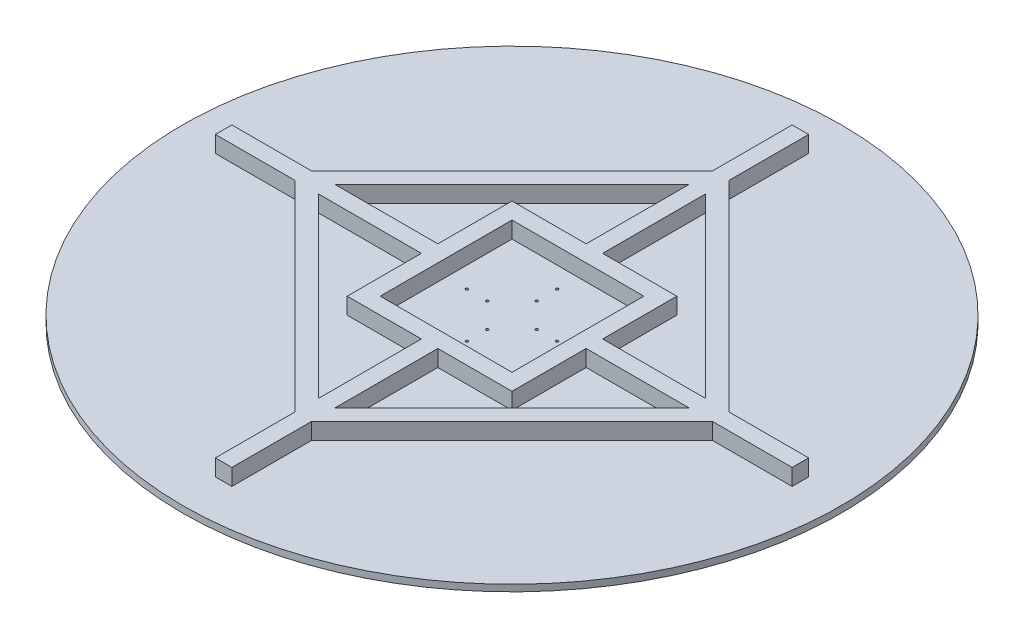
from build123d import *

# Parameters (mm, degrees)
SKETCH_1_R          = 400
SKETCH_1_R_2        = 1.55
EXTRUDE_1_DEPTH     = 8
SKETCH_3_R          = 1.55
CUT_EXTRUDE_1_DEPTH = 8
SKETCH_4_W          = 160
SKETCH_4_H          = 160
EXTRUDE_2_DEPTH     = 20


with BuildPart() as part:
    # Sketch 1 → Extrude 1 (new body)
    with BuildSketch(Plane(origin=(0, 0, 0), x_dir=(1, 0, 0), z_dir=(0, 1, 0))):
        with Locations(Location((0, 0, 0), (0, 0, 270))):
            Circle(SKETCH_1_R)
        with Locations(Location((54.8, 0, 0), (0, 0, 270))):
            Circle(SKETCH_1_R_2, mode=Mode.SUBTRACT)
        with Locations(Location((0, -54.8, 0), (0, 0, 270))):
            Circle(SKETCH_1_R_2, mode=Mode.SUBTRACT)
        with Locations(Location((-54.8, 0, 0), (0, 0, 270))):
            Circle(SKETCH_1_R_2, mode=Mode.SUBTRACT)
        with Locations(Location((0, 54.8, 0), (0, 0, 270))):
            Circle(SKETCH_1_R_2, mode=Mode.SUBTRACT)
    extrude(amount=EXTRUDE_1_DEPTH)

    # Sketch 3 → Cut-Extrude 1 (cut)
    with BuildSketch(Plane(origin=(0, 8, 0), x_dir=(1, 0, 0), z_dir=(0, 1, 0))):
        with Locations(Location((30, 0, 0), (0, 0, 270))):
            Circle(SKETCH_3_R)
        with Locations(Location((0, -30, 0), (0, 0, 270))):
            Circle(SKETCH_3_R)
        with Locations(Location((-30, 0, 0), (0, 0, 270))):
            Circle(SKETCH_3_R)
        with Locations(Location((0, 30, 0), (0, 0, 270))):
            Circle(SKETCH_3_R)
    extrude(amount=-CUT_EXTRUDE_1_DEPTH, mode=Mode.SUBTRACT)

    # Sketch 4 → Extrude 2 (add)
    with BuildSketch(Plane(origin=(0, 8, 0), x_dir=(1, 0, 0), z_dir=(0, 1, 0))):
        Polygon((10, 350), (10, 253.284271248), (253.284271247, 10), (350, 10), (350, -10), (253.284271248, -10), (10, -253.284271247), (10, -350), (-10, -350), (-10, -253.284271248), (-253.284271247, -10), (-350, -10), (-350, 10), (-253.284271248, 10), (-10, 253.284271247), (-10, 350), align=None)
        Polygon((100, -100), (100, -10), (225, -10), (10, -224.999999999), (10, -100), align=None, mode=Mode.SUBTRACT)
        Rectangle(SKETCH_4_W, SKETCH_4_H, mode=Mode.SUBTRACT)
        Polygon((-100, 100), (-10, 100), (-10, 224.999999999), (-225, 10), (-100, 10), align=None, mode=Mode.SUBTRACT)
        Polygon((-100, -100), (-100, -10), (-224.999999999, -10), (-10, -225), (-10, -100), align=None, mode=Mode.SUBTRACT)
        Polygon((100, 10), (224.999999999, 10), (10, 225), (10, 100), (100, 100), align=None, mode=Mode.SUBTRACT)
    extrude(amount=EXTRUDE_2_DEPTH)


solid = part.part
